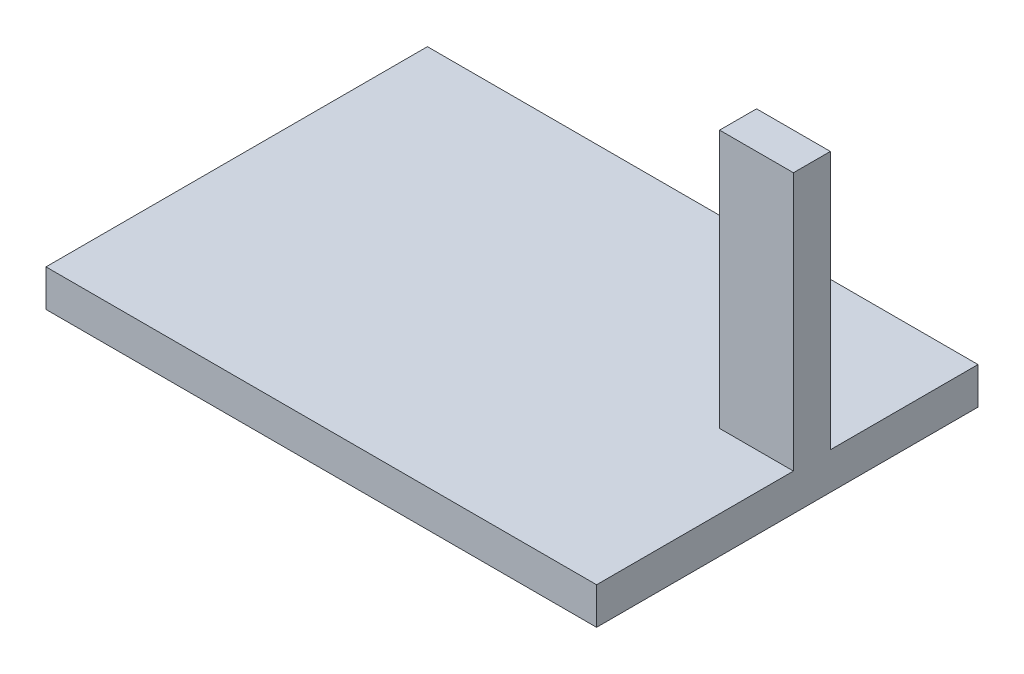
from build123d import *

# Parameters (mm, degrees)
SKETCH1_W           = 4546.6
SKETCH1_H           = 3149.6
BOSS_EXTRUDE1_DEPTH = 304.8
SKETCH2_W           = 609.6
SKETCH2_H           = 304.8
BOSS_EXTRUDE2_DEPTH = 2133.6


with BuildPart() as part:
    # Sketch1 → Boss-Extrude1 (new body)
    with BuildSketch(Plane(origin=(0, 0, 0), x_dir=(1, 0, 0), z_dir=(0, 1, 0))):
        Rectangle(SKETCH1_W, SKETCH1_H)
    extrude(amount=BOSS_EXTRUDE1_DEPTH)

    # Sketch2 → Boss-Extrude2 (add)
    with BuildSketch(Plane(origin=(0, 304.8, 0), x_dir=(1, 0, 0), z_dir=(0, 1, 0))):
        with Locations((1968.5, 203.2)):
            Rectangle(SKETCH2_W, SKETCH2_H)
    extrude(amount=BOSS_EXTRUDE2_DEPTH)


solid = part.part
